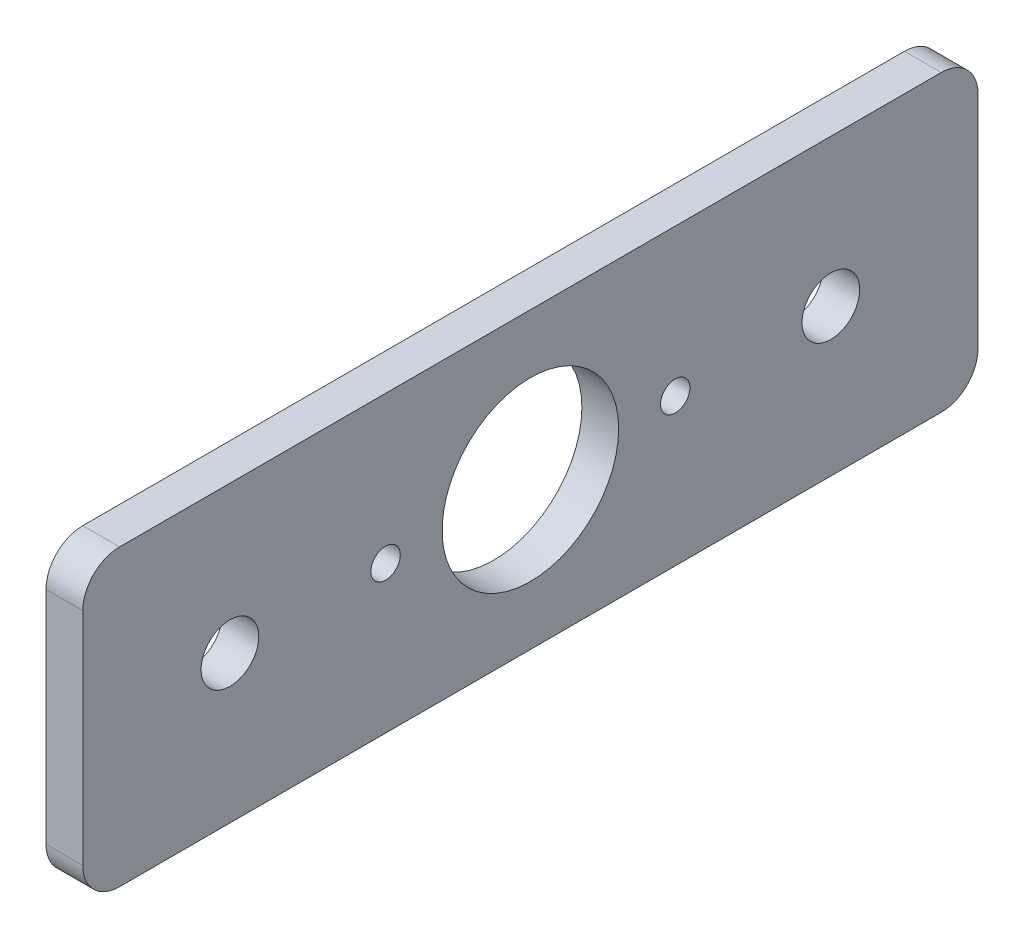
ISO-10303-21;
HEADER;
FILE_DESCRIPTION(('STEP AP214'),'2;1');
FILE_NAME('part.step','',(''),(''),'','','');
FILE_SCHEMA(('AUTOMOTIVE_DESIGN { 1 0 10303 214 1 1 1 1 }'));
ENDSEC;
DATA;
#1=APPLICATION_CONTEXT('core data for automotive mechanical design processes');
#2=APPLICATION_PROTOCOL_DEFINITION('international standard','automotive_design',2000,#1);
#3=PRODUCT_CONTEXT('',#1,'mechanical');
#4=PRODUCT('Part','Part','',(#3));
#5=PRODUCT_RELATED_PRODUCT_CATEGORY('part','',(#4));
#6=PRODUCT_DEFINITION_FORMATION('','',#4);
#7=PRODUCT_DEFINITION_CONTEXT('part definition',#1,'design');
#8=PRODUCT_DEFINITION('design','',#6,#7);
#9=PRODUCT_DEFINITION_SHAPE('','',#8);
#10=(LENGTH_UNIT() NAMED_UNIT(*) SI_UNIT(.MILLI.,.METRE.));
#11=(NAMED_UNIT(*) PLANE_ANGLE_UNIT() SI_UNIT($,.RADIAN.));
#12=(NAMED_UNIT(*) SI_UNIT($,.STERADIAN.) SOLID_ANGLE_UNIT());
#13=UNCERTAINTY_MEASURE_WITH_UNIT(LENGTH_MEASURE(1.E-05),#10,'distance_accuracy_value','');
#14=(GEOMETRIC_REPRESENTATION_CONTEXT(3) GLOBAL_UNCERTAINTY_ASSIGNED_CONTEXT((#13)) GLOBAL_UNIT_ASSIGNED_CONTEXT((#10,
#11,#12)) REPRESENTATION_CONTEXT('',''));
#15=CARTESIAN_POINT('',(0.,0.,0.));
#16=DIRECTION('',(0.,0.,1.));
#17=DIRECTION('',(1.,0.,0.));
#18=AXIS2_PLACEMENT_3D('',#15,#16,#17);
#19=CARTESIAN_POINT('',(3.175,0.,0.));
#20=DIRECTION('',(-1.,0.,0.));
#21=DIRECTION('',(0.,0.,1.));
#22=AXIS2_PLACEMENT_3D('',#19,#20,#21);
#23=PLANE('',#22);
#24=DIRECTION('',(0.,0.,-1.));
#25=VECTOR('',#24,1.);
#26=CARTESIAN_POINT('',(3.175,0.,0.));
#27=LINE('',#26,#25);
#28=CARTESIAN_POINT('',(3.175,0.,-3.175));
#29=VERTEX_POINT('',#28);
#30=CARTESIAN_POINT('',(3.175,0.,-74.0918));
#31=VERTEX_POINT('',#30);
#32=EDGE_CURVE('E172',#29,#31,#27,.T.);
#33=ORIENTED_EDGE('',*,*,#32,.T.);
#34=CARTESIAN_POINT('',(3.175,3.175,-74.0918));
#35=DIRECTION('',(-1.,0.,0.));
#36=DIRECTION('',(0.,0.,1.));
#37=AXIS2_PLACEMENT_3D('',#34,#35,#36);
#38=CIRCLE('',#37,3.175);
#39=CARTESIAN_POINT('',(3.175,3.175,-77.2668));
#40=VERTEX_POINT('',#39);
#41=EDGE_CURVE('E149',#31,#40,#38,.F.);
#42=ORIENTED_EDGE('',*,*,#41,.T.);
#43=DIRECTION('',(0.,1.,0.));
#44=VECTOR('',#43,1.);
#45=CARTESIAN_POINT('',(3.175,0.,-77.2668));
#46=LINE('',#45,#44);
#47=CARTESIAN_POINT('',(3.175,22.225,-77.2668));
#48=VERTEX_POINT('',#47);
#49=EDGE_CURVE('E119',#40,#48,#46,.T.);
#50=ORIENTED_EDGE('',*,*,#49,.T.);
#51=CARTESIAN_POINT('',(3.175,22.225,-74.0918));
#52=DIRECTION('',(-1.,0.,0.));
#53=DIRECTION('',(0.,0.,1.));
#54=AXIS2_PLACEMENT_3D('',#51,#52,#53);
#55=CIRCLE('',#54,3.175);
#56=CARTESIAN_POINT('',(3.175,25.4,-74.0918));
#57=VERTEX_POINT('',#56);
#58=EDGE_CURVE('E56',#48,#57,#55,.F.);
#59=ORIENTED_EDGE('',*,*,#58,.T.);
#60=DIRECTION('',(0.,0.,1.));
#61=VECTOR('',#60,1.);
#62=CARTESIAN_POINT('',(3.175,25.4,0.));
#63=LINE('',#62,#61);
#64=CARTESIAN_POINT('',(3.175,25.4,-3.175));
#65=VERTEX_POINT('',#64);
#66=EDGE_CURVE('E135',#57,#65,#63,.T.);
#67=ORIENTED_EDGE('',*,*,#66,.T.);
#68=CARTESIAN_POINT('',(3.175,22.225,-3.175));
#69=DIRECTION('',(-1.,0.,0.));
#70=DIRECTION('',(0.,0.,1.));
#71=AXIS2_PLACEMENT_3D('',#68,#69,#70);
#72=CIRCLE('',#71,3.175);
#73=CARTESIAN_POINT('',(3.175,22.225,0.));
#74=VERTEX_POINT('',#73);
#75=EDGE_CURVE('E144',#65,#74,#72,.F.);
#76=ORIENTED_EDGE('',*,*,#75,.T.);
#77=DIRECTION('',(0.,-1.,0.));
#78=VECTOR('',#77,1.);
#79=CARTESIAN_POINT('',(3.175,0.,0.));
#80=LINE('',#79,#78);
#81=CARTESIAN_POINT('',(3.175,3.175,0.));
#82=VERTEX_POINT('',#81);
#83=EDGE_CURVE('E129',#74,#82,#80,.T.);
#84=ORIENTED_EDGE('',*,*,#83,.T.);
#85=CARTESIAN_POINT('',(3.175,3.175,-3.175));
#86=DIRECTION('',(-1.,0.,0.));
#87=DIRECTION('',(0.,0.,1.));
#88=AXIS2_PLACEMENT_3D('',#85,#86,#87);
#89=CIRCLE('',#88,3.175);
#90=EDGE_CURVE('E146',#82,#29,#89,.F.);
#91=ORIENTED_EDGE('',*,*,#90,.T.);
#92=EDGE_LOOP('',(#33,#42,#50,#59,#67,#76,#84,#91));
#93=FACE_BOUND('',#92,.T.);
#94=CARTESIAN_POINT('',(3.175,12.7,-38.6334));
#95=DIRECTION('',(1.,0.,0.));
#96=DIRECTION('',(0.,0.,-1.));
#97=AXIS2_PLACEMENT_3D('',#94,#95,#96);
#98=CIRCLE('',#97,7.62);
#99=CARTESIAN_POINT('',(3.175,12.7,-46.2534));
#100=VERTEX_POINT('',#99);
#101=EDGE_CURVE('E165',#100,#100,#98,.T.);
#102=ORIENTED_EDGE('',*,*,#101,.F.);
#103=EDGE_LOOP('',(#102));
#104=FACE_BOUND('',#103,.T.);
#105=CARTESIAN_POINT('',(3.175,12.7,-51.1334));
#106=DIRECTION('',(1.,0.,0.));
#107=DIRECTION('',(0.,0.,-1.));
#108=AXIS2_PLACEMENT_3D('',#105,#106,#107);
#109=CIRCLE('',#108,1.27);
#110=CARTESIAN_POINT('',(3.175,12.7,-52.4034));
#111=VERTEX_POINT('',#110);
#112=EDGE_CURVE('E177',#111,#111,#109,.T.);
#113=ORIENTED_EDGE('',*,*,#112,.F.);
#114=EDGE_LOOP('',(#113));
#115=FACE_BOUND('',#114,.T.);
#116=CARTESIAN_POINT('',(3.175,12.7,-26.1334));
#117=DIRECTION('',(1.,0.,0.));
#118=DIRECTION('',(0.,0.,-1.));
#119=AXIS2_PLACEMENT_3D('',#116,#117,#118);
#120=CIRCLE('',#119,1.27);
#121=CARTESIAN_POINT('',(3.175,12.7,-27.4034));
#122=VERTEX_POINT('',#121);
#123=EDGE_CURVE('E182',#122,#122,#120,.T.);
#124=ORIENTED_EDGE('',*,*,#123,.F.);
#125=EDGE_LOOP('',(#124));
#126=FACE_BOUND('',#125,.T.);
#127=CARTESIAN_POINT('',(3.175,12.7,-64.5668));
#128=DIRECTION('',(1.,0.,0.));
#129=DIRECTION('',(0.,0.,-1.));
#130=AXIS2_PLACEMENT_3D('',#127,#128,#129);
#131=CIRCLE('',#130,2.4892);
#132=CARTESIAN_POINT('',(3.175,12.7,-67.056));
#133=VERTEX_POINT('',#132);
#134=EDGE_CURVE('E188',#133,#133,#131,.T.);
#135=ORIENTED_EDGE('',*,*,#134,.F.);
#136=EDGE_LOOP('',(#135));
#137=FACE_BOUND('',#136,.T.);
#138=CARTESIAN_POINT('',(3.175,12.7,-12.7));
#139=DIRECTION('',(1.,0.,0.));
#140=DIRECTION('',(0.,0.,-1.));
#141=AXIS2_PLACEMENT_3D('',#138,#139,#140);
#142=CIRCLE('',#141,2.4892);
#143=CARTESIAN_POINT('',(3.175,12.7,-15.1892));
#144=VERTEX_POINT('',#143);
#145=EDGE_CURVE('E194',#144,#144,#142,.T.);
#146=ORIENTED_EDGE('',*,*,#145,.F.);
#147=EDGE_LOOP('',(#146));
#148=FACE_BOUND('',#147,.T.);
#149=ADVANCED_FACE('F34',(#93,#104,#115,#126,#137,#148),#23,.F.);
#150=CARTESIAN_POINT('',(0.,0.,0.));
#151=DIRECTION('',(-1.,0.,0.));
#152=DIRECTION('',(0.,0.,1.));
#153=AXIS2_PLACEMENT_3D('',#150,#151,#152);
#154=PLANE('',#153);
#155=CARTESIAN_POINT('',(0.,12.7,-64.5668));
#156=DIRECTION('',(1.,0.,0.));
#157=DIRECTION('',(0.,0.,-1.));
#158=AXIS2_PLACEMENT_3D('',#155,#156,#157);
#159=CIRCLE('',#158,2.4892);
#160=CARTESIAN_POINT('',(0.,12.7,-67.056));
#161=VERTEX_POINT('',#160);
#162=EDGE_CURVE('E191',#161,#161,#159,.T.);
#163=ORIENTED_EDGE('',*,*,#162,.T.);
#164=EDGE_LOOP('',(#163));
#165=FACE_BOUND('',#164,.T.);
#166=CARTESIAN_POINT('',(0.,12.7,-51.1334));
#167=DIRECTION('',(1.,0.,0.));
#168=DIRECTION('',(0.,0.,-1.));
#169=AXIS2_PLACEMENT_3D('',#166,#167,#168);
#170=CIRCLE('',#169,1.27);
#171=CARTESIAN_POINT('',(0.,12.7,-52.4034));
#172=VERTEX_POINT('',#171);
#173=EDGE_CURVE('E179',#172,#172,#170,.T.);
#174=ORIENTED_EDGE('',*,*,#173,.T.);
#175=EDGE_LOOP('',(#174));
#176=FACE_BOUND('',#175,.T.);
#177=DIRECTION('',(0.,1.,0.));
#178=VECTOR('',#177,1.);
#179=CARTESIAN_POINT('',(0.,0.,-77.2668));
#180=LINE('',#179,#178);
#181=CARTESIAN_POINT('',(0.,3.175,-77.2668));
#182=VERTEX_POINT('',#181);
#183=CARTESIAN_POINT('',(0.,22.225,-77.2668));
#184=VERTEX_POINT('',#183);
#185=EDGE_CURVE('E117',#182,#184,#180,.T.);
#186=ORIENTED_EDGE('',*,*,#185,.F.);
#187=CARTESIAN_POINT('',(0.,3.175,-74.0918));
#188=DIRECTION('',(-1.,0.,0.));
#189=DIRECTION('',(0.,0.,1.));
#190=AXIS2_PLACEMENT_3D('',#187,#188,#189);
#191=CIRCLE('',#190,3.175);
#192=CARTESIAN_POINT('',(0.,0.,-74.0918));
#193=VERTEX_POINT('',#192);
#194=EDGE_CURVE('E100',#182,#193,#191,.T.);
#195=ORIENTED_EDGE('',*,*,#194,.T.);
#196=DIRECTION('',(0.,0.,-1.));
#197=VECTOR('',#196,1.);
#198=CARTESIAN_POINT('',(0.,0.,0.));
#199=LINE('',#198,#197);
#200=CARTESIAN_POINT('',(0.,0.,-3.175));
#201=VERTEX_POINT('',#200);
#202=EDGE_CURVE('E127',#201,#193,#199,.T.);
#203=ORIENTED_EDGE('',*,*,#202,.F.);
#204=CARTESIAN_POINT('',(0.,3.175,-3.175));
#205=DIRECTION('',(-1.,0.,0.));
#206=DIRECTION('',(0.,0.,1.));
#207=AXIS2_PLACEMENT_3D('',#204,#205,#206);
#208=CIRCLE('',#207,3.175);
#209=CARTESIAN_POINT('',(0.,3.175,0.));
#210=VERTEX_POINT('',#209);
#211=EDGE_CURVE('E138',#201,#210,#208,.T.);
#212=ORIENTED_EDGE('',*,*,#211,.T.);
#213=DIRECTION('',(0.,-1.,0.));
#214=VECTOR('',#213,1.);
#215=CARTESIAN_POINT('',(0.,0.,0.));
#216=LINE('',#215,#214);
#217=CARTESIAN_POINT('',(0.,22.225,0.));
#218=VERTEX_POINT('',#217);
#219=EDGE_CURVE('E131',#218,#210,#216,.T.);
#220=ORIENTED_EDGE('',*,*,#219,.F.);
#221=CARTESIAN_POINT('',(0.,22.225,-3.175));
#222=DIRECTION('',(-1.,0.,0.));
#223=DIRECTION('',(0.,0.,1.));
#224=AXIS2_PLACEMENT_3D('',#221,#222,#223);
#225=CIRCLE('',#224,3.175);
#226=CARTESIAN_POINT('',(0.,25.4,-3.175));
#227=VERTEX_POINT('',#226);
#228=EDGE_CURVE('E120',#218,#227,#225,.T.);
#229=ORIENTED_EDGE('',*,*,#228,.T.);
#230=DIRECTION('',(0.,0.,1.));
#231=VECTOR('',#230,1.);
#232=CARTESIAN_POINT('',(0.,25.4,0.));
#233=LINE('',#232,#231);
#234=CARTESIAN_POINT('',(0.,25.4,-74.0918));
#235=VERTEX_POINT('',#234);
#236=EDGE_CURVE('E126',#235,#227,#233,.T.);
#237=ORIENTED_EDGE('',*,*,#236,.F.);
#238=CARTESIAN_POINT('',(0.,22.225,-74.0918));
#239=DIRECTION('',(-1.,0.,0.));
#240=DIRECTION('',(0.,0.,1.));
#241=AXIS2_PLACEMENT_3D('',#238,#239,#240);
#242=CIRCLE('',#241,3.175);
#243=EDGE_CURVE('E111',#235,#184,#242,.T.);
#244=ORIENTED_EDGE('',*,*,#243,.T.);
#245=EDGE_LOOP('',(#186,#195,#203,#212,#220,#229,#237,#244));
#246=FACE_BOUND('',#245,.T.);
#247=CARTESIAN_POINT('',(0.,12.7,-38.6334));
#248=DIRECTION('',(1.,0.,0.));
#249=DIRECTION('',(0.,0.,-1.));
#250=AXIS2_PLACEMENT_3D('',#247,#248,#249);
#251=CIRCLE('',#250,7.62);
#252=CARTESIAN_POINT('',(0.,12.7,-46.2534));
#253=VERTEX_POINT('',#252);
#254=EDGE_CURVE('E167',#253,#253,#251,.T.);
#255=ORIENTED_EDGE('',*,*,#254,.T.);
#256=EDGE_LOOP('',(#255));
#257=FACE_BOUND('',#256,.T.);
#258=CARTESIAN_POINT('',(0.,12.7,-26.1334));
#259=DIRECTION('',(1.,0.,0.));
#260=DIRECTION('',(0.,0.,-1.));
#261=AXIS2_PLACEMENT_3D('',#258,#259,#260);
#262=CIRCLE('',#261,1.27);
#263=CARTESIAN_POINT('',(0.,12.7,-27.4034));
#264=VERTEX_POINT('',#263);
#265=EDGE_CURVE('E185',#264,#264,#262,.T.);
#266=ORIENTED_EDGE('',*,*,#265,.T.);
#267=EDGE_LOOP('',(#266));
#268=FACE_BOUND('',#267,.T.);
#269=CARTESIAN_POINT('',(0.,12.7,-12.7));
#270=DIRECTION('',(1.,0.,0.));
#271=DIRECTION('',(0.,0.,-1.));
#272=AXIS2_PLACEMENT_3D('',#269,#270,#271);
#273=CIRCLE('',#272,2.4892);
#274=CARTESIAN_POINT('',(0.,12.7,-15.1892));
#275=VERTEX_POINT('',#274);
#276=EDGE_CURVE('E197',#275,#275,#273,.T.);
#277=ORIENTED_EDGE('',*,*,#276,.T.);
#278=EDGE_LOOP('',(#277));
#279=FACE_BOUND('',#278,.T.);
#280=ADVANCED_FACE('F123',(#165,#176,#246,#257,#268,#279),#154,.T.);
#281=CARTESIAN_POINT('',(3.175,0.,0.));
#282=DIRECTION('',(0.,0.,-1.));
#283=DIRECTION('',(-1.,0.,0.));
#284=AXIS2_PLACEMENT_3D('',#281,#282,#283);
#285=PLANE('',#284);
#286=ORIENTED_EDGE('',*,*,#219,.T.);
#287=DIRECTION('',(-1.,0.,0.));
#288=VECTOR('',#287,1.);
#289=CARTESIAN_POINT('',(3.175,3.175,0.));
#290=LINE('',#289,#288);
#291=EDGE_CURVE('E11',#210,#82,#290,.F.);
#292=ORIENTED_EDGE('',*,*,#291,.T.);
#293=ORIENTED_EDGE('',*,*,#83,.F.);
#294=DIRECTION('',(-1.,0.,0.));
#295=VECTOR('',#294,1.);
#296=CARTESIAN_POINT('',(3.175,22.225,0.));
#297=LINE('',#296,#295);
#298=EDGE_CURVE('E42',#74,#218,#297,.T.);
#299=ORIENTED_EDGE('',*,*,#298,.T.);
#300=EDGE_LOOP('',(#286,#292,#293,#299));
#301=FACE_BOUND('',#300,.T.);
#302=ADVANCED_FACE('F160',(#301),#285,.F.);
#303=CARTESIAN_POINT('',(3.175,0.,0.));
#304=DIRECTION('',(0.,1.,0.));
#305=DIRECTION('',(0.,0.,1.));
#306=AXIS2_PLACEMENT_3D('',#303,#304,#305);
#307=PLANE('',#306);
#308=ORIENTED_EDGE('',*,*,#202,.T.);
#309=DIRECTION('',(-1.,0.,0.));
#310=VECTOR('',#309,1.);
#311=CARTESIAN_POINT('',(3.175,0.,-74.0918));
#312=LINE('',#311,#310);
#313=EDGE_CURVE('E105',#193,#31,#312,.F.);
#314=ORIENTED_EDGE('',*,*,#313,.T.);
#315=ORIENTED_EDGE('',*,*,#32,.F.);
#316=DIRECTION('',(-1.,0.,0.));
#317=VECTOR('',#316,1.);
#318=CARTESIAN_POINT('',(3.175,0.,-3.175));
#319=LINE('',#318,#317);
#320=EDGE_CURVE('E110',#29,#201,#319,.T.);
#321=ORIENTED_EDGE('',*,*,#320,.T.);
#322=EDGE_LOOP('',(#308,#314,#315,#321));
#323=FACE_BOUND('',#322,.T.);
#324=ADVANCED_FACE('F223',(#323),#307,.F.);
#325=CARTESIAN_POINT('',(3.175,0.,-77.2668));
#326=DIRECTION('',(0.,0.,1.));
#327=DIRECTION('',(1.,0.,0.));
#328=AXIS2_PLACEMENT_3D('',#325,#326,#327);
#329=PLANE('',#328);
#330=ORIENTED_EDGE('',*,*,#49,.F.);
#331=DIRECTION('',(-1.,0.,0.));
#332=VECTOR('',#331,1.);
#333=CARTESIAN_POINT('',(3.175,3.175,-77.2668));
#334=LINE('',#333,#332);
#335=EDGE_CURVE('E104',#40,#182,#334,.T.);
#336=ORIENTED_EDGE('',*,*,#335,.T.);
#337=ORIENTED_EDGE('',*,*,#185,.T.);
#338=DIRECTION('',(-1.,0.,0.));
#339=VECTOR('',#338,1.);
#340=CARTESIAN_POINT('',(3.175,22.225,-77.2668));
#341=LINE('',#340,#339);
#342=EDGE_CURVE('E121',#184,#48,#341,.F.);
#343=ORIENTED_EDGE('',*,*,#342,.T.);
#344=EDGE_LOOP('',(#330,#336,#337,#343));
#345=FACE_BOUND('',#344,.T.);
#346=ADVANCED_FACE('F116',(#345),#329,.F.);
#347=CARTESIAN_POINT('',(3.175,25.4,0.));
#348=DIRECTION('',(0.,-1.,0.));
#349=DIRECTION('',(0.,0.,-1.));
#350=AXIS2_PLACEMENT_3D('',#347,#348,#349);
#351=PLANE('',#350);
#352=ORIENTED_EDGE('',*,*,#66,.F.);
#353=DIRECTION('',(-1.,0.,0.));
#354=VECTOR('',#353,1.);
#355=CARTESIAN_POINT('',(3.175,25.4,-74.0918));
#356=LINE('',#355,#354);
#357=EDGE_CURVE('E152',#57,#235,#356,.T.);
#358=ORIENTED_EDGE('',*,*,#357,.T.);
#359=ORIENTED_EDGE('',*,*,#236,.T.);
#360=DIRECTION('',(-1.,0.,0.));
#361=VECTOR('',#360,1.);
#362=CARTESIAN_POINT('',(3.175,25.4,-3.175));
#363=LINE('',#362,#361);
#364=EDGE_CURVE('E49',#227,#65,#363,.F.);
#365=ORIENTED_EDGE('',*,*,#364,.T.);
#366=EDGE_LOOP('',(#352,#358,#359,#365));
#367=FACE_BOUND('',#366,.T.);
#368=ADVANCED_FACE('F218',(#367),#351,.F.);
#369=CARTESIAN_POINT('',(3.175,12.7,-38.6334));
#370=DIRECTION('',(-1.,0.,0.));
#371=DIRECTION('',(0.,0.,1.));
#372=AXIS2_PLACEMENT_3D('',#369,#370,#371);
#373=CYLINDRICAL_SURFACE('',#372,7.62);
#374=ORIENTED_EDGE('',*,*,#101,.T.);
#375=EDGE_LOOP('',(#374));
#376=FACE_BOUND('',#375,.T.);
#377=ORIENTED_EDGE('',*,*,#254,.F.);
#378=EDGE_LOOP('',(#377));
#379=FACE_BOUND('',#378,.T.);
#380=ADVANCED_FACE('F215',(#376,#379),#373,.F.);
#381=CARTESIAN_POINT('',(3.175,12.7,-51.1334));
#382=DIRECTION('',(-1.,0.,0.));
#383=DIRECTION('',(0.,0.,1.));
#384=AXIS2_PLACEMENT_3D('',#381,#382,#383);
#385=CYLINDRICAL_SURFACE('',#384,1.27);
#386=ORIENTED_EDGE('',*,*,#112,.T.);
#387=EDGE_LOOP('',(#386));
#388=FACE_BOUND('',#387,.T.);
#389=ORIENTED_EDGE('',*,*,#173,.F.);
#390=EDGE_LOOP('',(#389));
#391=FACE_BOUND('',#390,.T.);
#392=ADVANCED_FACE('F326',(#388,#391),#385,.F.);
#393=CARTESIAN_POINT('',(3.175,12.7,-26.1334));
#394=DIRECTION('',(-1.,0.,0.));
#395=DIRECTION('',(0.,0.,1.));
#396=AXIS2_PLACEMENT_3D('',#393,#394,#395);
#397=CYLINDRICAL_SURFACE('',#396,1.27);
#398=ORIENTED_EDGE('',*,*,#123,.T.);
#399=EDGE_LOOP('',(#398));
#400=FACE_BOUND('',#399,.T.);
#401=ORIENTED_EDGE('',*,*,#265,.F.);
#402=EDGE_LOOP('',(#401));
#403=FACE_BOUND('',#402,.T.);
#404=ADVANCED_FACE('F316',(#400,#403),#397,.F.);
#405=CARTESIAN_POINT('',(3.175,12.7,-64.5668));
#406=DIRECTION('',(-1.,0.,0.));
#407=DIRECTION('',(0.,0.,1.));
#408=AXIS2_PLACEMENT_3D('',#405,#406,#407);
#409=CYLINDRICAL_SURFACE('',#408,2.4892);
#410=ORIENTED_EDGE('',*,*,#134,.T.);
#411=EDGE_LOOP('',(#410));
#412=FACE_BOUND('',#411,.T.);
#413=ORIENTED_EDGE('',*,*,#162,.F.);
#414=EDGE_LOOP('',(#413));
#415=FACE_BOUND('',#414,.T.);
#416=ADVANCED_FACE('F307',(#412,#415),#409,.F.);
#417=CARTESIAN_POINT('',(3.175,12.7,-12.7));
#418=DIRECTION('',(-1.,0.,0.));
#419=DIRECTION('',(0.,0.,1.));
#420=AXIS2_PLACEMENT_3D('',#417,#418,#419);
#421=CYLINDRICAL_SURFACE('',#420,2.4892);
#422=ORIENTED_EDGE('',*,*,#145,.T.);
#423=EDGE_LOOP('',(#422));
#424=FACE_BOUND('',#423,.T.);
#425=ORIENTED_EDGE('',*,*,#276,.F.);
#426=EDGE_LOOP('',(#425));
#427=FACE_BOUND('',#426,.T.);
#428=ADVANCED_FACE('F203',(#424,#427),#421,.F.);
#429=CARTESIAN_POINT('',(3.175,3.175,-74.0918));
#430=DIRECTION('',(-1.,0.,0.));
#431=DIRECTION('',(0.,0.,1.));
#432=AXIS2_PLACEMENT_3D('',#429,#430,#431);
#433=CYLINDRICAL_SURFACE('',#432,3.175);
#434=ORIENTED_EDGE('',*,*,#41,.F.);
#435=ORIENTED_EDGE('',*,*,#313,.F.);
#436=ORIENTED_EDGE('',*,*,#194,.F.);
#437=ORIENTED_EDGE('',*,*,#335,.F.);
#438=EDGE_LOOP('',(#434,#435,#436,#437));
#439=FACE_BOUND('',#438,.T.);
#440=ADVANCED_FACE('F103',(#439),#433,.T.);
#441=CARTESIAN_POINT('',(3.175,22.225,-74.0918));
#442=DIRECTION('',(-1.,0.,0.));
#443=DIRECTION('',(0.,0.,1.));
#444=AXIS2_PLACEMENT_3D('',#441,#442,#443);
#445=CYLINDRICAL_SURFACE('',#444,3.175);
#446=ORIENTED_EDGE('',*,*,#58,.F.);
#447=ORIENTED_EDGE('',*,*,#342,.F.);
#448=ORIENTED_EDGE('',*,*,#243,.F.);
#449=ORIENTED_EDGE('',*,*,#357,.F.);
#450=EDGE_LOOP('',(#446,#447,#448,#449));
#451=FACE_BOUND('',#450,.T.);
#452=ADVANCED_FACE('F231',(#451),#445,.T.);
#453=CARTESIAN_POINT('',(3.175,3.175,-3.175));
#454=DIRECTION('',(-1.,0.,0.));
#455=DIRECTION('',(0.,0.,1.));
#456=AXIS2_PLACEMENT_3D('',#453,#454,#455);
#457=CYLINDRICAL_SURFACE('',#456,3.175);
#458=ORIENTED_EDGE('',*,*,#90,.F.);
#459=ORIENTED_EDGE('',*,*,#291,.F.);
#460=ORIENTED_EDGE('',*,*,#211,.F.);
#461=ORIENTED_EDGE('',*,*,#320,.F.);
#462=EDGE_LOOP('',(#458,#459,#460,#461));
#463=FACE_BOUND('',#462,.T.);
#464=ADVANCED_FACE('F233',(#463),#457,.T.);
#465=CARTESIAN_POINT('',(3.175,22.225,-3.175));
#466=DIRECTION('',(-1.,0.,0.));
#467=DIRECTION('',(0.,0.,1.));
#468=AXIS2_PLACEMENT_3D('',#465,#466,#467);
#469=CYLINDRICAL_SURFACE('',#468,3.175);
#470=ORIENTED_EDGE('',*,*,#75,.F.);
#471=ORIENTED_EDGE('',*,*,#364,.F.);
#472=ORIENTED_EDGE('',*,*,#228,.F.);
#473=ORIENTED_EDGE('',*,*,#298,.F.);
#474=EDGE_LOOP('',(#470,#471,#472,#473));
#475=FACE_BOUND('',#474,.T.);
#476=ADVANCED_FACE('F36',(#475),#469,.T.);
#477=CLOSED_SHELL('',(#149,#280,#302,#324,#346,#368,#380,#392,#404,#416,#428,#440,#452,#464,#476));
#478=MANIFOLD_SOLID_BREP('B2',#477);
#479=ADVANCED_BREP_SHAPE_REPRESENTATION('',(#18,#478),#14);
#480=SHAPE_DEFINITION_REPRESENTATION(#9,#479);
ENDSEC;
END-ISO-10303-21;
